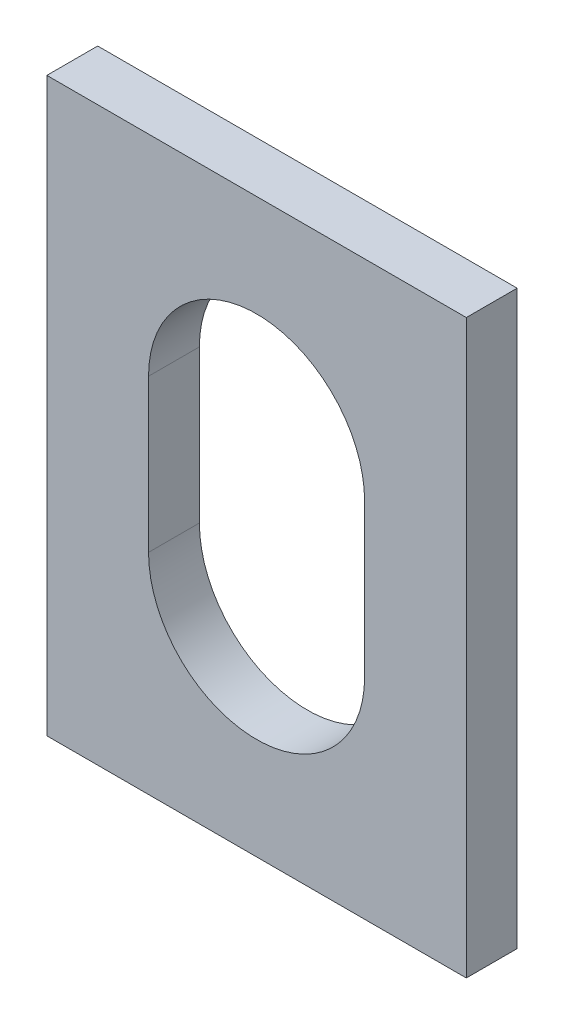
from build123d import *

# Parameters (mm, degrees)
SKETCH1_W           = 33
SKETCH1_H           = 45
BOSS_EXTRUDE1_DEPTH = 4


with BuildPart() as part:
    # Sketch1 → Boss-Extrude1 (new body)
    with BuildSketch(Plane.XY):
        with Locations((0, 6)):
            Rectangle(SKETCH1_W, SKETCH1_H)
        with BuildLine():
            Line((8.5, 0), (8.5, 12))
            ThreePointArc((8.5, 12), (0, 20.5), (-8.5, 12))
            Line((-8.5, 12), (-8.5, 0))
            ThreePointArc((-8.5, 0), (0, -8.5), (8.5, 0))
        make_face(mode=Mode.SUBTRACT)
    extrude(amount=BOSS_EXTRUDE1_DEPTH)


solid = part.part
